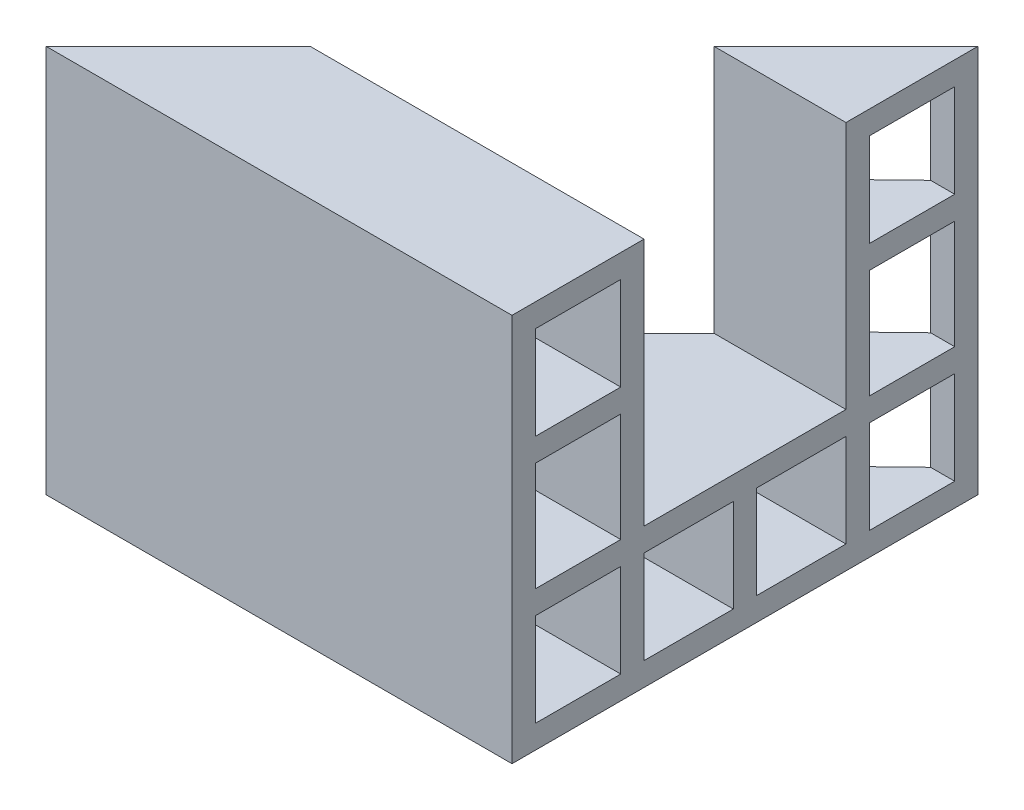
from build123d import *

# Parameters (mm, degrees)
ESQUISSE1_W             = 5.5
ESQUISSE1_H             = 7
ESQUISSE1_H_2           = 6
ESQUISSE1_W_2           = 5.75
EXTRUSION1_DEPTH        = 30
D_POUILLE1_ANGLE        = 1
ENL_V_MAT_EXTRU_1_DEPTH = 50.244289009


with BuildPart() as part:
    # Esquisse1 → Extrusion1 (new body)
    with BuildSketch(Plane(origin=(0, 0, 0), x_dir=(0, 0, -1), z_dir=(1, 0, 0))):
        Polygon((8.5, 9), (8.5, 25), (0, 25), (0, 0), (30, 0), (30, 25), (21.5, 25), (21.5, 9), align=None)
        with Locations((4.25, 12.5)):
            Rectangle(ESQUISSE1_W, ESQUISSE1_H, mode=Mode.SUBTRACT)
        with Locations((4.25, 4.5)):
            Rectangle(ESQUISSE1_W, ESQUISSE1_H_2, mode=Mode.SUBTRACT)
        with Locations((4.25, 20.5)):
            Rectangle(ESQUISSE1_W, ESQUISSE1_H_2, mode=Mode.SUBTRACT)
        with Locations((11.375, 4.5)):
            Rectangle(ESQUISSE1_W_2, ESQUISSE1_H_2, mode=Mode.SUBTRACT)
        with Locations((18.625, 4.5)):
            Rectangle(ESQUISSE1_W_2, ESQUISSE1_H_2, mode=Mode.SUBTRACT)
        with Locations((25.75, 20.5)):
            Rectangle(ESQUISSE1_W, ESQUISSE1_H_2, mode=Mode.SUBTRACT)
        with Locations((25.75, 12.5)):
            Rectangle(ESQUISSE1_W, ESQUISSE1_H, mode=Mode.SUBTRACT)
        with Locations((25.75, 4.5)):
            Rectangle(ESQUISSE1_W, ESQUISSE1_H_2, mode=Mode.SUBTRACT)
    extrude(amount=EXTRUSION1_DEPTH)

    # D_pouille1
    d_pouille1_faces = [part.faces().sort_by_distance(p)[0] for p in [
        (15, 23.5, -25.75),
        (15, 20.5, -23),
        (15, 16, -25.75),
        (15, 12.5, -23),
        (15, 7.5, -25.75),
        (15, 4.5, -23),
        (15, 7.5, -18.625),
        (15, 4.5, -15.75),
        (15, 7.5, -11.375),
        (15, 4.5, -8.5),
        (15, 23.5, -4.25),
        (15, 20.5, -1.5),
        (15, 16, -4.25),
        (15, 12.5, -1.5),
        (15, 7.5, -4.25),
        (15, 4.5, -1.5),
        (15, 20.5, -28.5),
        (15, 17.5, -25.75),
        (15, 12.5, -28.5),
        (15, 9, -25.75),
        (15, 4.5, -28.5),
        (15, 1.5, -25.75),
        (15, 4.5, -21.5),
        (15, 1.5, -18.625),
        (15, 4.5, -14.25),
        (15, 1.5, -11.375),
        (15, 4.5, -7),
        (15, 1.5, -4.25),
        (15, 12.5, -7),
        (15, 9, -4.25),
        (15, 20.5, -7),
        (15, 17.5, -4.25),
    ]]
    draft(d_pouille1_faces, Plane(origin=(30, 9, -21.5), x_dir=(0, 0, 1), z_dir=(1, 0, 0)), D_POUILLE1_ANGLE)

    # Esquisse2 → Enl_v. mat.-Extru.1 (cut, through all)
    with BuildSketch(Plane(origin=(0, 25, 0), x_dir=(-1, 0, 0), z_dir=(0, 1, 0))):
        Polygon((-31.733480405, -31.733480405), (1.268911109, -31.733480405), (1.268911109, 1.268911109), align=None)
    extrude(amount=-ENL_V_MAT_EXTRU_1_DEPTH, mode=Mode.SUBTRACT)


solid = part.part
